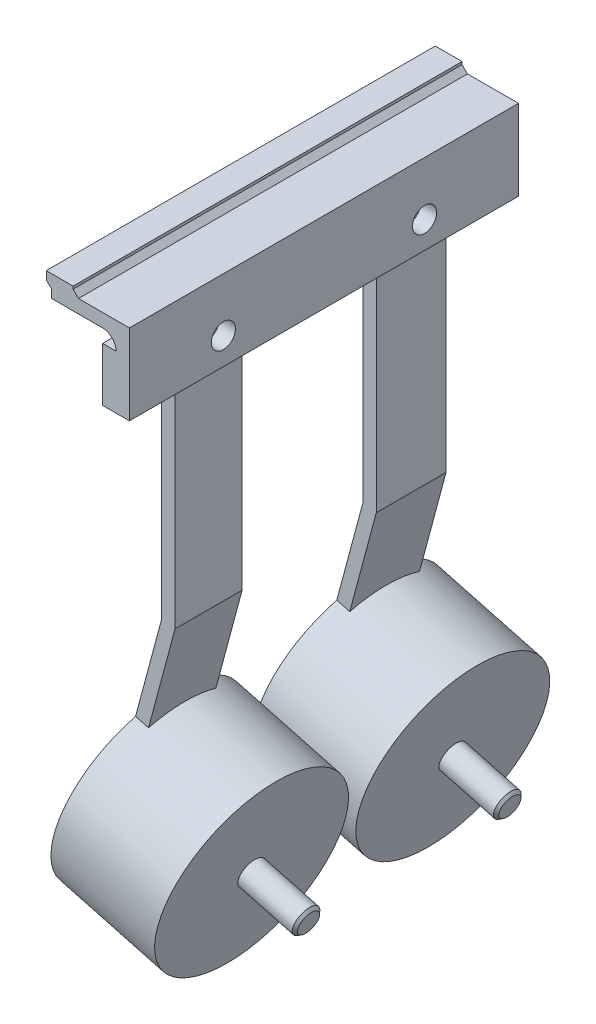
ISO-10303-21;
HEADER;
FILE_DESCRIPTION(('STEP AP214'),'2;1');
FILE_NAME('part.step','',(''),(''),'','','');
FILE_SCHEMA(('AUTOMOTIVE_DESIGN { 1 0 10303 214 1 1 1 1 }'));
ENDSEC;
DATA;
#1=APPLICATION_CONTEXT('core data for automotive mechanical design processes');
#2=APPLICATION_PROTOCOL_DEFINITION('international standard','automotive_design',2000,#1);
#3=PRODUCT_CONTEXT('',#1,'mechanical');
#4=PRODUCT('Part','Part','',(#3));
#5=PRODUCT_RELATED_PRODUCT_CATEGORY('part','',(#4));
#6=PRODUCT_DEFINITION_FORMATION('','',#4);
#7=PRODUCT_DEFINITION_CONTEXT('part definition',#1,'design');
#8=PRODUCT_DEFINITION('design','',#6,#7);
#9=PRODUCT_DEFINITION_SHAPE('','',#8);
#10=(LENGTH_UNIT() NAMED_UNIT(*) SI_UNIT(.MILLI.,.METRE.));
#11=(NAMED_UNIT(*) PLANE_ANGLE_UNIT() SI_UNIT($,.RADIAN.));
#12=(NAMED_UNIT(*) SI_UNIT($,.STERADIAN.) SOLID_ANGLE_UNIT());
#13=UNCERTAINTY_MEASURE_WITH_UNIT(LENGTH_MEASURE(1.E-05),#10,'distance_accuracy_value','');
#14=(GEOMETRIC_REPRESENTATION_CONTEXT(3) GLOBAL_UNCERTAINTY_ASSIGNED_CONTEXT((#13)) GLOBAL_UNIT_ASSIGNED_CONTEXT((#10,
#11,#12)) REPRESENTATION_CONTEXT('',''));
#15=CARTESIAN_POINT('',(0.,0.,0.));
#16=DIRECTION('',(0.,0.,1.));
#17=DIRECTION('',(1.,0.,0.));
#18=AXIS2_PLACEMENT_3D('',#15,#16,#17);
#19=CARTESIAN_POINT('',(-54.1861548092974,140.960408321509,145.));
#20=DIRECTION('',(0.,-1.,0.));
#21=DIRECTION('',(1.,0.,0.));
#22=AXIS2_PLACEMENT_3D('',#19,#20,#21);
#23=PLANE('',#22);
#24=DIRECTION('',(-1.,0.,0.));
#25=VECTOR('',#24,1.);
#26=CARTESIAN_POINT('',(-54.1861548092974,140.960408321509,0.));
#27=LINE('',#26,#25);
#28=CARTESIAN_POINT('',(-54.1861548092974,140.960408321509,0.));
#29=VERTEX_POINT('',#28);
#30=CARTESIAN_POINT('',(-73.1861548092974,140.960408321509,0.));
#31=VERTEX_POINT('',#30);
#32=EDGE_CURVE('E294',#29,#31,#27,.T.);
#33=ORIENTED_EDGE('',*,*,#32,.T.);
#34=DIRECTION('',(0.,0.,1.));
#35=VECTOR('',#34,1.);
#36=CARTESIAN_POINT('',(-73.1861548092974,140.960408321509,145.));
#37=LINE('',#36,#35);
#38=CARTESIAN_POINT('',(-73.1861548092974,140.960408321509,145.));
#39=VERTEX_POINT('',#38);
#40=EDGE_CURVE('E314',#31,#39,#37,.T.);
#41=ORIENTED_EDGE('',*,*,#40,.T.);
#42=DIRECTION('',(-1.,0.,0.));
#43=VECTOR('',#42,1.);
#44=CARTESIAN_POINT('',(-54.1861548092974,140.960408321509,145.));
#45=LINE('',#44,#43);
#46=CARTESIAN_POINT('',(-54.1861548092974,140.960408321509,145.));
#47=VERTEX_POINT('',#46);
#48=EDGE_CURVE('E285',#47,#39,#45,.T.);
#49=ORIENTED_EDGE('',*,*,#48,.F.);
#50=DIRECTION('',(0.,0.,1.));
#51=VECTOR('',#50,1.);
#52=CARTESIAN_POINT('',(-54.1861548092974,140.960408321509,145.));
#53=LINE('',#52,#51);
#54=EDGE_CURVE('E283',#29,#47,#53,.T.);
#55=ORIENTED_EDGE('',*,*,#54,.F.);
#56=EDGE_LOOP('',(#33,#41,#49,#55));
#57=FACE_BOUND('',#56,.T.);
#58=ADVANCED_FACE('F38',(#57),#23,.F.);
#59=CARTESIAN_POINT('',(-64.1861548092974,130.960408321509,145.));
#60=DIRECTION('',(1.,0.,0.));
#61=DIRECTION('',(0.,1.,0.));
#62=AXIS2_PLACEMENT_3D('',#59,#60,#61);
#63=PLANE('',#62);
#64=CARTESIAN_POINT('',(-64.1861548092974,120.960408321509,110.));
#65=DIRECTION('',(-1.,0.,0.));
#66=DIRECTION('',(0.,0.,1.));
#67=AXIS2_PLACEMENT_3D('',#64,#65,#66);
#68=CIRCLE('',#67,8.64999999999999);
#69=CARTESIAN_POINT('',(-64.1861548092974,120.960408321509,118.65));
#70=VERTEX_POINT('',#69);
#71=EDGE_CURVE('E271',#70,#70,#68,.T.);
#72=ORIENTED_EDGE('',*,*,#71,.F.);
#73=EDGE_LOOP('',(#72));
#74=FACE_BOUND('',#73,.T.);
#75=DIRECTION('',(0.,-1.,0.));
#76=VECTOR('',#75,1.);
#77=CARTESIAN_POINT('',(-64.1861548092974,130.960408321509,123.));
#78=LINE('',#77,#76);
#79=CARTESIAN_POINT('',(-64.1861548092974,110.963112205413,123.));
#80=VERTEX_POINT('',#79);
#81=CARTESIAN_POINT('',(-64.1861548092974,30.9604083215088,123.));
#82=VERTEX_POINT('',#81);
#83=EDGE_CURVE('E466',#80,#82,#78,.T.);
#84=ORIENTED_EDGE('',*,*,#83,.F.);
#85=DIRECTION('',(0.,0.,-1.));
#86=VECTOR('',#85,1.);
#87=CARTESIAN_POINT('',(-64.1861548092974,110.963112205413,145.));
#88=LINE('',#87,#86);
#89=CARTESIAN_POINT('',(-64.1861548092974,110.963112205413,145.));
#90=VERTEX_POINT('',#89);
#91=EDGE_CURVE('E443',#90,#80,#88,.T.);
#92=ORIENTED_EDGE('',*,*,#91,.F.);
#93=DIRECTION('',(0.,-1.,0.));
#94=VECTOR('',#93,1.);
#95=CARTESIAN_POINT('',(-64.1861548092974,130.960408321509,145.));
#96=LINE('',#95,#94);
#97=CARTESIAN_POINT('',(-64.1861548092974,130.960408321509,145.));
#98=VERTEX_POINT('',#97);
#99=EDGE_CURVE('E469',#98,#90,#96,.T.);
#100=ORIENTED_EDGE('',*,*,#99,.F.);
#101=DIRECTION('',(0.,0.,-1.));
#102=VECTOR('',#101,1.);
#103=CARTESIAN_POINT('',(-64.1861548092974,130.960408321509,145.));
#104=LINE('',#103,#102);
#105=CARTESIAN_POINT('',(-64.1861548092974,130.960408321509,0.));
#106=VERTEX_POINT('',#105);
#107=EDGE_CURVE('E384',#98,#106,#104,.T.);
#108=ORIENTED_EDGE('',*,*,#107,.T.);
#109=DIRECTION('',(0.,-1.,0.));
#110=VECTOR('',#109,1.);
#111=CARTESIAN_POINT('',(-64.1861548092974,130.960408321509,0.));
#112=LINE('',#111,#110);
#113=CARTESIAN_POINT('',(-64.1861548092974,110.963112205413,0.));
#114=VERTEX_POINT('',#113);
#115=EDGE_CURVE('E468',#106,#114,#112,.T.);
#116=ORIENTED_EDGE('',*,*,#115,.T.);
#117=DIRECTION('',(0.,0.,-1.));
#118=VECTOR('',#117,1.);
#119=CARTESIAN_POINT('',(-64.1861548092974,110.963112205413,145.));
#120=LINE('',#119,#118);
#121=CARTESIAN_POINT('',(-64.1861548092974,110.963112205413,22.));
#122=VERTEX_POINT('',#121);
#123=EDGE_CURVE('E436',#122,#114,#120,.T.);
#124=ORIENTED_EDGE('',*,*,#123,.F.);
#125=DIRECTION('',(0.,1.,0.));
#126=VECTOR('',#125,1.);
#127=CARTESIAN_POINT('',(-64.1861548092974,130.960408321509,22.));
#128=LINE('',#127,#126);
#129=CARTESIAN_POINT('',(-64.1861548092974,30.9604083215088,22.));
#130=VERTEX_POINT('',#129);
#131=EDGE_CURVE('E462',#130,#122,#128,.T.);
#132=ORIENTED_EDGE('',*,*,#131,.F.);
#133=DIRECTION('',(0.,0.,-1.));
#134=VECTOR('',#133,1.);
#135=CARTESIAN_POINT('',(-64.1861548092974,30.9604083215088,145.));
#136=LINE('',#135,#134);
#137=CARTESIAN_POINT('',(-64.1861548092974,30.9604083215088,48.));
#138=VERTEX_POINT('',#137);
#139=EDGE_CURVE('E394',#138,#130,#136,.T.);
#140=ORIENTED_EDGE('',*,*,#139,.F.);
#141=DIRECTION('',(0.,-1.,0.));
#142=VECTOR('',#141,1.);
#143=CARTESIAN_POINT('',(-64.1861548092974,130.960408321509,48.));
#144=LINE('',#143,#142);
#145=CARTESIAN_POINT('',(-64.1861548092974,110.963112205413,48.));
#146=VERTEX_POINT('',#145);
#147=EDGE_CURVE('E458',#146,#138,#144,.T.);
#148=ORIENTED_EDGE('',*,*,#147,.F.);
#149=DIRECTION('',(0.,0.,-1.));
#150=VECTOR('',#149,1.);
#151=CARTESIAN_POINT('',(-64.1861548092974,110.963112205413,145.));
#152=LINE('',#151,#150);
#153=CARTESIAN_POINT('',(-64.1861548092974,110.963112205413,98.));
#154=VERTEX_POINT('',#153);
#155=EDGE_CURVE('E454',#154,#146,#152,.T.);
#156=ORIENTED_EDGE('',*,*,#155,.F.);
#157=DIRECTION('',(0.,1.,0.));
#158=VECTOR('',#157,1.);
#159=CARTESIAN_POINT('',(-64.1861548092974,130.960408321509,98.));
#160=LINE('',#159,#158);
#161=CARTESIAN_POINT('',(-64.1861548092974,30.9604083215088,98.));
#162=VERTEX_POINT('',#161);
#163=EDGE_CURVE('E452',#162,#154,#160,.T.);
#164=ORIENTED_EDGE('',*,*,#163,.F.);
#165=EDGE_CURVE('E397',#82,#162,#136,.T.);
#166=ORIENTED_EDGE('',*,*,#165,.F.);
#167=EDGE_LOOP('',(#84,#92,#100,#108,#116,#124,#132,#140,#148,#156,#164,#166));
#168=FACE_BOUND('',#167,.T.);
#169=CARTESIAN_POINT('',(-64.1861548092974,120.960408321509,35.));
#170=DIRECTION('',(-1.,0.,0.));
#171=DIRECTION('',(0.,0.,1.));
#172=AXIS2_PLACEMENT_3D('',#169,#170,#171);
#173=CIRCLE('',#172,8.64999999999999);
#174=CARTESIAN_POINT('',(-64.1861548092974,120.960408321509,43.65));
#175=VERTEX_POINT('',#174);
#176=EDGE_CURVE('E264',#175,#175,#173,.T.);
#177=ORIENTED_EDGE('',*,*,#176,.F.);
#178=EDGE_LOOP('',(#177));
#179=FACE_BOUND('',#178,.T.);
#180=ADVANCED_FACE('F40',(#74,#168,#179),#63,.F.);
#181=CARTESIAN_POINT('',(-59.1861548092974,30.302145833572,145.));
#182=DIRECTION('',(-1.,0.,0.));
#183=DIRECTION('',(0.,-1.,0.));
#184=AXIS2_PLACEMENT_3D('',#181,#182,#183);
#185=PLANE('',#184);
#186=DIRECTION('',(0.,0.,-1.));
#187=VECTOR('',#186,1.);
#188=CARTESIAN_POINT('',(-59.1861548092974,110.960408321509,145.));
#189=LINE('',#188,#187);
#190=CARTESIAN_POINT('',(-59.1861548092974,110.960408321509,123.));
#191=VERTEX_POINT('',#190);
#192=CARTESIAN_POINT('',(-59.1861548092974,110.960408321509,98.));
#193=VERTEX_POINT('',#192);
#194=EDGE_CURVE('E345',#191,#193,#189,.T.);
#195=ORIENTED_EDGE('',*,*,#194,.F.);
#196=DIRECTION('',(0.,1.,0.));
#197=VECTOR('',#196,1.);
#198=CARTESIAN_POINT('',(-59.1861548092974,30.302145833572,123.));
#199=LINE('',#198,#197);
#200=CARTESIAN_POINT('',(-59.1861548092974,30.3021458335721,123.));
#201=VERTEX_POINT('',#200);
#202=EDGE_CURVE('E361',#201,#191,#199,.T.);
#203=ORIENTED_EDGE('',*,*,#202,.F.);
#204=DIRECTION('',(0.,0.,-1.));
#205=VECTOR('',#204,1.);
#206=CARTESIAN_POINT('',(-59.1861548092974,30.302145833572,145.));
#207=LINE('',#206,#205);
#208=CARTESIAN_POINT('',(-59.1861548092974,30.3021458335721,98.));
#209=VERTEX_POINT('',#208);
#210=EDGE_CURVE('E393',#201,#209,#207,.T.);
#211=ORIENTED_EDGE('',*,*,#210,.T.);
#212=DIRECTION('',(0.,-1.,0.));
#213=VECTOR('',#212,1.);
#214=CARTESIAN_POINT('',(-59.1861548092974,30.302145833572,98.));
#215=LINE('',#214,#213);
#216=EDGE_CURVE('E404',#193,#209,#215,.T.);
#217=ORIENTED_EDGE('',*,*,#216,.F.);
#218=EDGE_LOOP('',(#195,#203,#211,#217));
#219=FACE_BOUND('',#218,.T.);
#220=ADVANCED_FACE('F594',(#219),#185,.F.);
#221=CARTESIAN_POINT('',(-59.1861548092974,110.960408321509,48.));
#222=VERTEX_POINT('',#221);
#223=CARTESIAN_POINT('',(-59.1861548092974,110.960408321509,22.));
#224=VERTEX_POINT('',#223);
#225=EDGE_CURVE('E349',#222,#224,#189,.T.);
#226=ORIENTED_EDGE('',*,*,#225,.F.);
#227=DIRECTION('',(0.,1.,0.));
#228=VECTOR('',#227,1.);
#229=CARTESIAN_POINT('',(-59.1861548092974,30.302145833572,48.));
#230=LINE('',#229,#228);
#231=CARTESIAN_POINT('',(-59.1861548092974,30.3021458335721,48.));
#232=VERTEX_POINT('',#231);
#233=EDGE_CURVE('E370',#232,#222,#230,.T.);
#234=ORIENTED_EDGE('',*,*,#233,.F.);
#235=CARTESIAN_POINT('',(-59.1861548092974,30.3021458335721,22.));
#236=VERTEX_POINT('',#235);
#237=EDGE_CURVE('E383',#232,#236,#207,.T.);
#238=ORIENTED_EDGE('',*,*,#237,.T.);
#239=DIRECTION('',(0.,-1.,0.));
#240=VECTOR('',#239,1.);
#241=CARTESIAN_POINT('',(-59.1861548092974,30.302145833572,22.));
#242=LINE('',#241,#240);
#243=EDGE_CURVE('E368',#224,#236,#242,.T.);
#244=ORIENTED_EDGE('',*,*,#243,.F.);
#245=EDGE_LOOP('',(#226,#234,#238,#244));
#246=FACE_BOUND('',#245,.T.);
#247=ADVANCED_FACE('F630',(#246),#185,.F.);
#248=CARTESIAN_POINT('',(-43.6664549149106,-47.0071613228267,35.));
#249=DIRECTION('',(0.96592582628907,-0.258819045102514,0.));
#250=DIRECTION('',(0.258819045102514,0.96592582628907,0.));
#251=AXIS2_PLACEMENT_3D('',#248,#249,#250);
#252=PLANE('',#251);
#253=CARTESIAN_POINT('',(-43.6664549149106,-47.0071613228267,35.));
#254=DIRECTION('',(0.96592582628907,-0.258819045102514,0.));
#255=DIRECTION('',(0.258819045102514,0.96592582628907,0.));
#256=AXIS2_PLACEMENT_3D('',#253,#254,#255);
#257=CIRCLE('',#256,35.);
#258=CARTESIAN_POINT('',(-34.6077883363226,-13.1997574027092,35.));
#259=VERTEX_POINT('',#258);
#260=EDGE_CURVE('E531',#259,#259,#257,.T.);
#261=ORIENTED_EDGE('',*,*,#260,.T.);
#262=EDGE_LOOP('',(#261));
#263=FACE_BOUND('',#262,.T.);
#264=CARTESIAN_POINT('',(-43.6664549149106,-47.0071613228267,35.));
#265=DIRECTION('',(0.96592582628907,-0.258819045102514,0.));
#266=DIRECTION('',(0.258819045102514,0.96592582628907,0.));
#267=AXIS2_PLACEMENT_3D('',#264,#265,#266);
#268=CIRCLE('',#267,5.);
#269=CARTESIAN_POINT('',(-42.372359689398,-42.1775321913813,35.));
#270=VERTEX_POINT('',#269);
#271=EDGE_CURVE('E539',#270,#270,#268,.T.);
#272=ORIENTED_EDGE('',*,*,#271,.F.);
#273=EDGE_LOOP('',(#272));
#274=FACE_BOUND('',#273,.T.);
#275=ADVANCED_FACE('F626',(#263,#274),#252,.T.);
#276=CARTESIAN_POINT('',(-43.6664549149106,-47.0071613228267,110.));
#277=DIRECTION('',(0.96592582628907,-0.258819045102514,0.));
#278=DIRECTION('',(0.258819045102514,0.96592582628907,0.));
#279=AXIS2_PLACEMENT_3D('',#276,#277,#278);
#280=PLANE('',#279);
#281=CARTESIAN_POINT('',(-43.6664549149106,-47.0071613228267,110.));
#282=DIRECTION('',(0.96592582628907,-0.258819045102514,0.));
#283=DIRECTION('',(0.258819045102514,0.96592582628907,0.));
#284=AXIS2_PLACEMENT_3D('',#281,#282,#283);
#285=CIRCLE('',#284,35.);
#286=CARTESIAN_POINT('',(-34.6077883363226,-13.1997574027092,110.));
#287=VERTEX_POINT('',#286);
#288=EDGE_CURVE('E525',#287,#287,#285,.T.);
#289=ORIENTED_EDGE('',*,*,#288,.T.);
#290=EDGE_LOOP('',(#289));
#291=FACE_BOUND('',#290,.T.);
#292=CARTESIAN_POINT('',(-43.6664549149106,-47.0071613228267,110.));
#293=DIRECTION('',(0.96592582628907,-0.258819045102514,0.));
#294=DIRECTION('',(0.258819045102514,0.96592582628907,0.));
#295=AXIS2_PLACEMENT_3D('',#292,#293,#294);
#296=CIRCLE('',#295,5.00000000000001);
#297=CARTESIAN_POINT('',(-42.372359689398,-42.1775321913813,110.));
#298=VERTEX_POINT('',#297);
#299=EDGE_CURVE('E536',#298,#298,#296,.T.);
#300=ORIENTED_EDGE('',*,*,#299,.F.);
#301=EDGE_LOOP('',(#300));
#302=FACE_BOUND('',#301,.T.);
#303=ADVANCED_FACE('F629',(#291,#302),#280,.T.);
#304=CARTESIAN_POINT('',(-68.4151922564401,-4.14109082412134,145.));
#305=DIRECTION('',(-0.96592582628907,0.258819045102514,0.));
#306=DIRECTION('',(-0.258819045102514,-0.96592582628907,0.));
#307=AXIS2_PLACEMENT_3D('',#304,#305,#306);
#308=PLANE('',#307);
#309=CARTESIAN_POINT('',(-77.473858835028,-37.9484947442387,35.));
#310=DIRECTION('',(0.96592582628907,-0.258819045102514,0.));
#311=DIRECTION('',(0.258819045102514,0.96592582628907,0.));
#312=AXIS2_PLACEMENT_3D('',#309,#310,#311);
#313=CIRCLE('',#312,35.);
#314=CARTESIAN_POINT('',(-69.0632353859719,-6.55962070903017,22.));
#315=VERTEX_POINT('',#314);
#316=CARTESIAN_POINT('',(-69.063235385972,-6.55962070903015,48.));
#317=VERTEX_POINT('',#316);
#318=EDGE_CURVE('E534',#315,#317,#313,.T.);
#319=ORIENTED_EDGE('',*,*,#318,.F.);
#320=DIRECTION('',(0.258819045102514,0.96592582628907,0.));
#321=VECTOR('',#320,1.);
#322=CARTESIAN_POINT('',(-69.063235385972,-6.55962070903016,22.));
#323=LINE('',#322,#321);
#324=EDGE_CURVE('E494',#315,#236,#323,.T.);
#325=ORIENTED_EDGE('',*,*,#324,.T.);
#326=ORIENTED_EDGE('',*,*,#237,.F.);
#327=DIRECTION('',(-0.258819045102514,-0.96592582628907,0.));
#328=VECTOR('',#327,1.);
#329=CARTESIAN_POINT('',(-69.063235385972,-6.55962070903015,48.));
#330=LINE('',#329,#328);
#331=EDGE_CURVE('E513',#232,#317,#330,.T.);
#332=ORIENTED_EDGE('',*,*,#331,.T.);
#333=EDGE_LOOP('',(#319,#325,#326,#332));
#334=FACE_BOUND('',#333,.T.);
#335=ADVANCED_FACE('F634',(#334),#308,.F.);
#336=CARTESIAN_POINT('',(-77.473858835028,-37.9484947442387,110.));
#337=DIRECTION('',(0.96592582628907,-0.258819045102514,0.));
#338=DIRECTION('',(0.258819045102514,0.96592582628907,0.));
#339=AXIS2_PLACEMENT_3D('',#336,#337,#338);
#340=CIRCLE('',#339,35.);
#341=CARTESIAN_POINT('',(-68.9642601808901,-6.19024021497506,98.));
#342=VERTEX_POINT('',#341);
#343=CARTESIAN_POINT('',(-69.063235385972,-6.55962070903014,123.));
#344=VERTEX_POINT('',#343);
#345=EDGE_CURVE('E528',#342,#344,#340,.T.);
#346=ORIENTED_EDGE('',*,*,#345,.F.);
#347=DIRECTION('',(0.258819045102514,0.96592582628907,0.));
#348=VECTOR('',#347,1.);
#349=CARTESIAN_POINT('',(-68.9642601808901,-6.19024021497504,98.));
#350=LINE('',#349,#348);
#351=EDGE_CURVE('E518',#342,#209,#350,.T.);
#352=ORIENTED_EDGE('',*,*,#351,.T.);
#353=ORIENTED_EDGE('',*,*,#210,.F.);
#354=DIRECTION('',(-0.258819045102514,-0.96592582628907,0.));
#355=VECTOR('',#354,1.);
#356=CARTESIAN_POINT('',(-69.063235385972,-6.55962070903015,123.));
#357=LINE('',#356,#355);
#358=EDGE_CURVE('E521',#201,#344,#357,.T.);
#359=ORIENTED_EDGE('',*,*,#358,.T.);
#360=EDGE_LOOP('',(#346,#352,#353,#359));
#361=FACE_BOUND('',#360,.T.);
#362=ADVANCED_FACE('F675',(#361),#308,.F.);
#363=CARTESIAN_POINT('',(-64.1861548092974,30.9604083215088,145.));
#364=DIRECTION('',(0.96592582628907,-0.258819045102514,0.));
#365=DIRECTION('',(0.258819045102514,0.96592582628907,0.));
#366=AXIS2_PLACEMENT_3D('',#363,#364,#365);
#367=PLANE('',#366);
#368=DIRECTION('',(-0.258819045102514,-0.96592582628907,0.));
#369=VECTOR('',#368,1.);
#370=CARTESIAN_POINT('',(-64.1861548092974,30.9604083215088,48.));
#371=LINE('',#370,#369);
#372=CARTESIAN_POINT('',(-73.8928645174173,-5.26552548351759,48.));
#373=VERTEX_POINT('',#372);
#374=EDGE_CURVE('E456',#138,#373,#371,.T.);
#375=ORIENTED_EDGE('',*,*,#374,.F.);
#376=ORIENTED_EDGE('',*,*,#139,.T.);
#377=DIRECTION('',(0.258819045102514,0.96592582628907,0.));
#378=VECTOR('',#377,1.);
#379=CARTESIAN_POINT('',(-64.1861548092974,30.9604083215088,22.));
#380=LINE('',#379,#378);
#381=CARTESIAN_POINT('',(-73.8928645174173,-5.2655254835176,22.));
#382=VERTEX_POINT('',#381);
#383=EDGE_CURVE('E460',#382,#130,#380,.T.);
#384=ORIENTED_EDGE('',*,*,#383,.F.);
#385=CARTESIAN_POINT('',(-82.3034879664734,-36.6543995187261,35.));
#386=DIRECTION('',(0.96592582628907,-0.258819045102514,0.));
#387=DIRECTION('',(0.258819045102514,0.96592582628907,0.));
#388=AXIS2_PLACEMENT_3D('',#385,#386,#387);
#389=CIRCLE('',#388,35.);
#390=EDGE_CURVE('E441',#373,#382,#389,.T.);
#391=ORIENTED_EDGE('',*,*,#390,.F.);
#392=EDGE_LOOP('',(#375,#376,#384,#391));
#393=FACE_BOUND('',#392,.T.);
#394=ADVANCED_FACE('F676',(#393),#367,.F.);
#395=DIRECTION('',(-0.258819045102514,-0.96592582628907,0.));
#396=VECTOR('',#395,1.);
#397=CARTESIAN_POINT('',(-64.1861548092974,30.9604083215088,123.));
#398=LINE('',#397,#396);
#399=CARTESIAN_POINT('',(-73.8928645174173,-5.26552548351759,123.));
#400=VERTEX_POINT('',#399);
#401=EDGE_CURVE('E464',#82,#400,#398,.T.);
#402=ORIENTED_EDGE('',*,*,#401,.F.);
#403=ORIENTED_EDGE('',*,*,#165,.T.);
#404=DIRECTION('',(0.258819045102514,0.96592582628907,0.));
#405=VECTOR('',#404,1.);
#406=CARTESIAN_POINT('',(-64.1861548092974,30.9604083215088,98.));
#407=LINE('',#406,#405);
#408=CARTESIAN_POINT('',(-73.7938893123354,-4.89614498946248,98.));
#409=VERTEX_POINT('',#408);
#410=EDGE_CURVE('E450',#409,#162,#407,.T.);
#411=ORIENTED_EDGE('',*,*,#410,.F.);
#412=CARTESIAN_POINT('',(-82.3034879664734,-36.6543995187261,110.));
#413=DIRECTION('',(0.96592582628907,-0.258819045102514,0.));
#414=DIRECTION('',(0.258819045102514,0.96592582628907,0.));
#415=AXIS2_PLACEMENT_3D('',#412,#413,#414);
#416=CIRCLE('',#415,35.);
#417=EDGE_CURVE('E440',#400,#409,#416,.T.);
#418=ORIENTED_EDGE('',*,*,#417,.F.);
#419=EDGE_LOOP('',(#402,#403,#411,#418));
#420=FACE_BOUND('',#419,.T.);
#421=ADVANCED_FACE('F668',(#420),#367,.F.);
#422=CARTESIAN_POINT('',(-64.1861548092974,130.960408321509,145.));
#423=DIRECTION('',(0.,0.,1.));
#424=DIRECTION('',(1.,0.,0.));
#425=AXIS2_PLACEMENT_3D('',#422,#423,#424);
#426=PLANE('',#425);
#427=DIRECTION('',(-1.,0.,0.));
#428=VECTOR('',#427,1.);
#429=CARTESIAN_POINT('',(-64.1861548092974,110.960408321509,145.));
#430=LINE('',#429,#428);
#431=CARTESIAN_POINT('',(-54.1861548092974,110.960408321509,145.));
#432=VERTEX_POINT('',#431);
#433=CARTESIAN_POINT('',(-64.1760637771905,110.960408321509,145.));
#434=VERTEX_POINT('',#433);
#435=EDGE_CURVE('E542',#432,#434,#430,.T.);
#436=ORIENTED_EDGE('',*,*,#435,.F.);
#437=DIRECTION('',(0.,-1.,0.));
#438=VECTOR('',#437,1.);
#439=CARTESIAN_POINT('',(-54.1861548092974,110.960408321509,145.));
#440=LINE('',#439,#438);
#441=EDGE_CURVE('E275',#47,#432,#440,.T.);
#442=ORIENTED_EDGE('',*,*,#441,.F.);
#443=ORIENTED_EDGE('',*,*,#48,.T.);
#444=DIRECTION('',(0.70710678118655,-0.707106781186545,0.));
#445=VECTOR('',#444,1.);
#446=CARTESIAN_POINT('',(-75.1861548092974,142.960408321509,145.));
#447=LINE('',#446,#445);
#448=CARTESIAN_POINT('',(-75.1861548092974,142.960408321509,145.));
#449=VERTEX_POINT('',#448);
#450=EDGE_CURVE('E230',#39,#449,#447,.F.);
#451=ORIENTED_EDGE('',*,*,#450,.T.);
#452=DIRECTION('',(0.,-1.,0.));
#453=VECTOR('',#452,1.);
#454=CARTESIAN_POINT('',(-75.1861548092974,143.960408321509,145.));
#455=LINE('',#454,#453);
#456=CARTESIAN_POINT('',(-75.1861548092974,143.960408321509,145.));
#457=VERTEX_POINT('',#456);
#458=EDGE_CURVE('E250',#457,#449,#455,.T.);
#459=ORIENTED_EDGE('',*,*,#458,.F.);
#460=DIRECTION('',(1.,0.,0.));
#461=VECTOR('',#460,1.);
#462=CARTESIAN_POINT('',(-75.1861548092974,143.960408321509,145.));
#463=LINE('',#462,#461);
#464=CARTESIAN_POINT('',(-85.1861548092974,143.960408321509,145.));
#465=VERTEX_POINT('',#464);
#466=EDGE_CURVE('E248',#465,#457,#463,.T.);
#467=ORIENTED_EDGE('',*,*,#466,.F.);
#468=DIRECTION('',(0.,-1.,0.));
#469=VECTOR('',#468,1.);
#470=CARTESIAN_POINT('',(-85.1861548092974,143.960408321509,145.));
#471=LINE('',#470,#469);
#472=CARTESIAN_POINT('',(-85.1861548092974,140.960408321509,145.));
#473=VERTEX_POINT('',#472);
#474=EDGE_CURVE('E237',#465,#473,#471,.T.);
#475=ORIENTED_EDGE('',*,*,#474,.T.);
#476=DIRECTION('',(0.707106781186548,-0.707106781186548,0.));
#477=VECTOR('',#476,1.);
#478=CARTESIAN_POINT('',(-83.1861548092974,138.960408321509,145.));
#479=LINE('',#478,#477);
#480=CARTESIAN_POINT('',(-83.1861548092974,138.960408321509,145.));
#481=VERTEX_POINT('',#480);
#482=EDGE_CURVE('E11',#473,#481,#479,.T.);
#483=ORIENTED_EDGE('',*,*,#482,.T.);
#484=DIRECTION('',(0.,1.,0.));
#485=VECTOR('',#484,1.);
#486=CARTESIAN_POINT('',(-83.1861548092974,140.960408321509,145.));
#487=LINE('',#486,#485);
#488=CARTESIAN_POINT('',(-83.1861548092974,135.960408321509,145.));
#489=VERTEX_POINT('',#488);
#490=EDGE_CURVE('E254',#489,#481,#487,.T.);
#491=ORIENTED_EDGE('',*,*,#490,.F.);
#492=DIRECTION('',(1.,0.,0.));
#493=VECTOR('',#492,1.);
#494=CARTESIAN_POINT('',(-83.1861548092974,135.960408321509,145.));
#495=LINE('',#494,#493);
#496=CARTESIAN_POINT('',(-64.1861548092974,135.960408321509,145.));
#497=VERTEX_POINT('',#496);
#498=EDGE_CURVE('E255',#489,#497,#495,.T.);
#499=ORIENTED_EDGE('',*,*,#498,.T.);
#500=CARTESIAN_POINT('',(-64.1861548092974,130.960408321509,145.));
#501=DIRECTION('',(0.,0.,1.));
#502=DIRECTION('',(1.,0.,0.));
#503=AXIS2_PLACEMENT_3D('',#500,#501,#502);
#504=CIRCLE('',#503,5.);
#505=CARTESIAN_POINT('',(-59.1861548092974,130.960408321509,145.));
#506=VERTEX_POINT('',#505);
#507=EDGE_CURVE('E337',#497,#506,#504,.F.);
#508=ORIENTED_EDGE('',*,*,#507,.T.);
#509=DIRECTION('',(-1.,0.,0.));
#510=VECTOR('',#509,1.);
#511=CARTESIAN_POINT('',(-64.1861548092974,130.960408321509,145.));
#512=LINE('',#511,#510);
#513=EDGE_CURVE('E471',#506,#98,#512,.T.);
#514=ORIENTED_EDGE('',*,*,#513,.T.);
#515=ORIENTED_EDGE('',*,*,#99,.T.);
#516=DIRECTION('',(0.96592582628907,-0.258819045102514,0.));
#517=VECTOR('',#516,1.);
#518=CARTESIAN_POINT('',(-69.1854788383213,112.302677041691,145.));
#519=LINE('',#518,#517);
#520=EDGE_CURVE('E401',#90,#434,#519,.T.);
#521=ORIENTED_EDGE('',*,*,#520,.T.);
#522=EDGE_LOOP('',(#436,#442,#443,#451,#459,#467,#475,#483,#491,#499,#508,#514,#515,#521));
#523=FACE_BOUND('',#522,.T.);
#524=ADVANCED_FACE('F322',(#523),#426,.T.);
#525=CARTESIAN_POINT('',(-64.1861548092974,130.960408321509,0.));
#526=DIRECTION('',(0.,0.,1.));
#527=DIRECTION('',(1.,0.,0.));
#528=AXIS2_PLACEMENT_3D('',#525,#526,#527);
#529=PLANE('',#528);
#530=DIRECTION('',(-1.,0.,0.));
#531=VECTOR('',#530,1.);
#532=CARTESIAN_POINT('',(-64.1861548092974,130.960408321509,0.));
#533=LINE('',#532,#531);
#534=CARTESIAN_POINT('',(-59.1861548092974,130.960408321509,0.));
#535=VERTEX_POINT('',#534);
#536=EDGE_CURVE('E385',#535,#106,#533,.T.);
#537=ORIENTED_EDGE('',*,*,#536,.F.);
#538=CARTESIAN_POINT('',(-64.1861548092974,130.960408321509,0.));
#539=DIRECTION('',(0.,0.,1.));
#540=DIRECTION('',(1.,0.,0.));
#541=AXIS2_PLACEMENT_3D('',#538,#539,#540);
#542=CIRCLE('',#541,5.);
#543=CARTESIAN_POINT('',(-64.1861548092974,135.960408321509,0.));
#544=VERTEX_POINT('',#543);
#545=EDGE_CURVE('E336',#535,#544,#542,.T.);
#546=ORIENTED_EDGE('',*,*,#545,.T.);
#547=DIRECTION('',(1.,0.,0.));
#548=VECTOR('',#547,1.);
#549=CARTESIAN_POINT('',(-83.1861548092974,135.960408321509,0.));
#550=LINE('',#549,#548);
#551=CARTESIAN_POINT('',(-83.1861548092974,135.960408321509,0.));
#552=VERTEX_POINT('',#551);
#553=EDGE_CURVE('E258',#552,#544,#550,.T.);
#554=ORIENTED_EDGE('',*,*,#553,.F.);
#555=DIRECTION('',(0.,-1.,0.));
#556=VECTOR('',#555,1.);
#557=CARTESIAN_POINT('',(-83.1861548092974,140.960408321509,0.));
#558=LINE('',#557,#556);
#559=CARTESIAN_POINT('',(-83.1861548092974,138.960408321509,0.));
#560=VERTEX_POINT('',#559);
#561=EDGE_CURVE('E229',#560,#552,#558,.T.);
#562=ORIENTED_EDGE('',*,*,#561,.F.);
#563=DIRECTION('',(-0.707106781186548,0.707106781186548,0.));
#564=VECTOR('',#563,1.);
#565=CARTESIAN_POINT('',(-69.6861548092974,125.460408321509,0.));
#566=LINE('',#565,#564);
#567=CARTESIAN_POINT('',(-85.1861548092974,140.960408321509,0.));
#568=VERTEX_POINT('',#567);
#569=EDGE_CURVE('E46',#560,#568,#566,.T.);
#570=ORIENTED_EDGE('',*,*,#569,.T.);
#571=DIRECTION('',(0.,-1.,0.));
#572=VECTOR('',#571,1.);
#573=CARTESIAN_POINT('',(-85.1861548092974,143.960408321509,0.));
#574=LINE('',#573,#572);
#575=CARTESIAN_POINT('',(-85.1861548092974,143.960408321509,0.));
#576=VERTEX_POINT('',#575);
#577=EDGE_CURVE('E226',#576,#568,#574,.T.);
#578=ORIENTED_EDGE('',*,*,#577,.F.);
#579=DIRECTION('',(-1.,0.,0.));
#580=VECTOR('',#579,1.);
#581=CARTESIAN_POINT('',(-75.1861548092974,143.960408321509,0.));
#582=LINE('',#581,#580);
#583=CARTESIAN_POINT('',(-75.1861548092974,143.960408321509,0.));
#584=VERTEX_POINT('',#583);
#585=EDGE_CURVE('E243',#584,#576,#582,.T.);
#586=ORIENTED_EDGE('',*,*,#585,.F.);
#587=DIRECTION('',(0.,-1.,0.));
#588=VECTOR('',#587,1.);
#589=CARTESIAN_POINT('',(-75.1861548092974,143.960408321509,0.));
#590=LINE('',#589,#588);
#591=CARTESIAN_POINT('',(-75.1861548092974,142.960408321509,0.));
#592=VERTEX_POINT('',#591);
#593=EDGE_CURVE('E236',#584,#592,#590,.T.);
#594=ORIENTED_EDGE('',*,*,#593,.T.);
#595=DIRECTION('',(-0.70710678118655,0.707106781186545,0.));
#596=VECTOR('',#595,1.);
#597=CARTESIAN_POINT('',(-63.6861548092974,131.460408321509,0.));
#598=LINE('',#597,#596);
#599=EDGE_CURVE('E318',#592,#31,#598,.F.);
#600=ORIENTED_EDGE('',*,*,#599,.T.);
#601=ORIENTED_EDGE('',*,*,#32,.F.);
#602=DIRECTION('',(0.,1.,0.));
#603=VECTOR('',#602,1.);
#604=CARTESIAN_POINT('',(-54.1861548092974,110.960408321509,0.));
#605=LINE('',#604,#603);
#606=CARTESIAN_POINT('',(-54.1861548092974,110.960408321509,0.));
#607=VERTEX_POINT('',#606);
#608=EDGE_CURVE('E281',#607,#29,#605,.T.);
#609=ORIENTED_EDGE('',*,*,#608,.F.);
#610=DIRECTION('',(-1.,0.,0.));
#611=VECTOR('',#610,1.);
#612=CARTESIAN_POINT('',(-64.1861548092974,110.960408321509,0.));
#613=LINE('',#612,#611);
#614=CARTESIAN_POINT('',(-64.1760637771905,110.960408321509,0.));
#615=VERTEX_POINT('',#614);
#616=EDGE_CURVE('E376',#607,#615,#613,.T.);
#617=ORIENTED_EDGE('',*,*,#616,.T.);
#618=DIRECTION('',(0.96592582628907,-0.258819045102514,0.));
#619=VECTOR('',#618,1.);
#620=CARTESIAN_POINT('',(-69.1854788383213,112.302677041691,0.));
#621=LINE('',#620,#619);
#622=EDGE_CURVE('E398',#114,#615,#621,.T.);
#623=ORIENTED_EDGE('',*,*,#622,.F.);
#624=ORIENTED_EDGE('',*,*,#115,.F.);
#625=EDGE_LOOP('',(#537,#546,#554,#562,#570,#578,#586,#594,#600,#601,#609,#617,#623,#624));
#626=FACE_BOUND('',#625,.T.);
#627=ADVANCED_FACE('F225',(#626),#529,.F.);
#628=CARTESIAN_POINT('',(-64.1861548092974,130.960408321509,145.));
#629=DIRECTION('',(0.,-1.,0.));
#630=DIRECTION('',(0.,0.,-1.));
#631=AXIS2_PLACEMENT_3D('',#628,#629,#630);
#632=PLANE('',#631);
#633=ORIENTED_EDGE('',*,*,#536,.T.);
#634=ORIENTED_EDGE('',*,*,#107,.F.);
#635=ORIENTED_EDGE('',*,*,#513,.F.);
#636=DIRECTION('',(0.,0.,-1.));
#637=VECTOR('',#636,1.);
#638=CARTESIAN_POINT('',(-59.1861548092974,130.960408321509,145.));
#639=LINE('',#638,#637);
#640=EDGE_CURVE('E380',#506,#535,#639,.T.);
#641=ORIENTED_EDGE('',*,*,#640,.T.);
#642=EDGE_LOOP('',(#633,#634,#635,#641));
#643=FACE_BOUND('',#642,.T.);
#644=ADVANCED_FACE('F476',(#643),#632,.F.);
#645=CARTESIAN_POINT('',(-124.248417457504,8.22720426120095,123.));
#646=DIRECTION('',(0.,0.,1.));
#647=DIRECTION('',(1.,0.,0.));
#648=AXIS2_PLACEMENT_3D('',#645,#646,#647);
#649=PLANE('',#648);
#650=ORIENTED_EDGE('',*,*,#202,.T.);
#651=DIRECTION('',(1.,0.,0.));
#652=VECTOR('',#651,1.);
#653=CARTESIAN_POINT('',(-91.3621545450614,110.960408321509,123.));
#654=LINE('',#653,#652);
#655=CARTESIAN_POINT('',(-64.1760637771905,110.960408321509,123.));
#656=VERTEX_POINT('',#655);
#657=EDGE_CURVE('E432',#656,#191,#654,.T.);
#658=ORIENTED_EDGE('',*,*,#657,.F.);
#659=DIRECTION('',(0.96592582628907,-0.258819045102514,0.));
#660=VECTOR('',#659,1.);
#661=CARTESIAN_POINT('',(-94.5410317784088,119.096676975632,123.));
#662=LINE('',#661,#660);
#663=EDGE_CURVE('E445',#80,#656,#662,.T.);
#664=ORIENTED_EDGE('',*,*,#663,.F.);
#665=ORIENTED_EDGE('',*,*,#83,.T.);
#666=ORIENTED_EDGE('',*,*,#401,.T.);
#667=DIRECTION('',(0.96592582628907,-0.258819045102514,0.));
#668=VECTOR('',#667,1.);
#669=CARTESIAN_POINT('',(-124.248417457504,8.22720426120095,123.));
#670=LINE('',#669,#668);
#671=EDGE_CURVE('E509',#400,#344,#670,.T.);
#672=ORIENTED_EDGE('',*,*,#671,.T.);
#673=ORIENTED_EDGE('',*,*,#358,.F.);
#674=EDGE_LOOP('',(#650,#658,#664,#665,#666,#672,#673));
#675=FACE_BOUND('',#674,.T.);
#676=ADVANCED_FACE('F488',(#675),#649,.T.);
#677=CARTESIAN_POINT('',(-124.248417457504,8.22720426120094,22.));
#678=DIRECTION('',(0.,0.,-1.));
#679=DIRECTION('',(0.,1.,0.));
#680=AXIS2_PLACEMENT_3D('',#677,#678,#679);
#681=PLANE('',#680);
#682=ORIENTED_EDGE('',*,*,#131,.T.);
#683=DIRECTION('',(0.96592582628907,-0.258819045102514,0.));
#684=VECTOR('',#683,1.);
#685=CARTESIAN_POINT('',(-94.5410317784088,119.096676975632,22.));
#686=LINE('',#685,#684);
#687=CARTESIAN_POINT('',(-64.1760637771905,110.960408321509,22.));
#688=VERTEX_POINT('',#687);
#689=EDGE_CURVE('E437',#122,#688,#686,.T.);
#690=ORIENTED_EDGE('',*,*,#689,.T.);
#691=DIRECTION('',(1.,0.,0.));
#692=VECTOR('',#691,1.);
#693=CARTESIAN_POINT('',(-91.3621545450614,110.960408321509,22.));
#694=LINE('',#693,#692);
#695=EDGE_CURVE('E373',#688,#224,#694,.T.);
#696=ORIENTED_EDGE('',*,*,#695,.T.);
#697=ORIENTED_EDGE('',*,*,#243,.T.);
#698=ORIENTED_EDGE('',*,*,#324,.F.);
#699=DIRECTION('',(0.96592582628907,-0.258819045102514,0.));
#700=VECTOR('',#699,1.);
#701=CARTESIAN_POINT('',(-124.248417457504,8.22720426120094,22.));
#702=LINE('',#701,#700);
#703=EDGE_CURVE('E491',#382,#315,#702,.T.);
#704=ORIENTED_EDGE('',*,*,#703,.F.);
#705=ORIENTED_EDGE('',*,*,#383,.T.);
#706=EDGE_LOOP('',(#682,#690,#696,#697,#698,#704,#705));
#707=FACE_BOUND('',#706,.T.);
#708=ADVANCED_FACE('F642',(#707),#681,.T.);
#709=CARTESIAN_POINT('',(-124.248417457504,8.22720426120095,48.));
#710=DIRECTION('',(0.,0.,1.));
#711=DIRECTION('',(1.,0.,0.));
#712=AXIS2_PLACEMENT_3D('',#709,#710,#711);
#713=PLANE('',#712);
#714=ORIENTED_EDGE('',*,*,#147,.T.);
#715=ORIENTED_EDGE('',*,*,#374,.T.);
#716=DIRECTION('',(0.96592582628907,-0.258819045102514,0.));
#717=VECTOR('',#716,1.);
#718=CARTESIAN_POINT('',(-124.248417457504,8.22720426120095,48.));
#719=LINE('',#718,#717);
#720=EDGE_CURVE('E499',#373,#317,#719,.T.);
#721=ORIENTED_EDGE('',*,*,#720,.T.);
#722=ORIENTED_EDGE('',*,*,#331,.F.);
#723=ORIENTED_EDGE('',*,*,#233,.T.);
#724=DIRECTION('',(1.,0.,0.));
#725=VECTOR('',#724,1.);
#726=CARTESIAN_POINT('',(-91.3621545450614,110.960408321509,48.));
#727=LINE('',#726,#725);
#728=CARTESIAN_POINT('',(-64.1760637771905,110.960408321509,48.));
#729=VERTEX_POINT('',#728);
#730=EDGE_CURVE('E548',#729,#222,#727,.T.);
#731=ORIENTED_EDGE('',*,*,#730,.F.);
#732=DIRECTION('',(0.96592582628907,-0.258819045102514,0.));
#733=VECTOR('',#732,1.);
#734=CARTESIAN_POINT('',(-94.5410317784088,119.096676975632,48.));
#735=LINE('',#734,#733);
#736=EDGE_CURVE('E501',#146,#729,#735,.T.);
#737=ORIENTED_EDGE('',*,*,#736,.F.);
#738=EDGE_LOOP('',(#714,#715,#721,#722,#723,#731,#737));
#739=FACE_BOUND('',#738,.T.);
#740=ADVANCED_FACE('F645',(#739),#713,.T.);
#741=CARTESIAN_POINT('',(-94.5410317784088,119.096676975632,98.));
#742=DIRECTION('',(-0.258819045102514,-0.96592582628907,0.));
#743=DIRECTION('',(0.96592582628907,-0.258819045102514,0.));
#744=AXIS2_PLACEMENT_3D('',#741,#742,#743);
#745=PLANE('',#744);
#746=DIRECTION('',(0.,0.,-1.));
#747=VECTOR('',#746,1.);
#748=CARTESIAN_POINT('',(-64.1760637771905,110.960408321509,98.));
#749=LINE('',#748,#747);
#750=CARTESIAN_POINT('',(-64.1760637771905,110.960408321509,98.));
#751=VERTEX_POINT('',#750);
#752=EDGE_CURVE('E377',#751,#729,#749,.T.);
#753=ORIENTED_EDGE('',*,*,#752,.F.);
#754=DIRECTION('',(0.96592582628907,-0.258819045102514,0.));
#755=VECTOR('',#754,1.);
#756=CARTESIAN_POINT('',(-94.5410317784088,119.096676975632,98.));
#757=LINE('',#756,#755);
#758=EDGE_CURVE('E504',#154,#751,#757,.T.);
#759=ORIENTED_EDGE('',*,*,#758,.F.);
#760=ORIENTED_EDGE('',*,*,#155,.T.);
#761=ORIENTED_EDGE('',*,*,#736,.T.);
#762=EDGE_LOOP('',(#753,#759,#760,#761));
#763=FACE_BOUND('',#762,.T.);
#764=ADVANCED_FACE('F652',(#763),#745,.T.);
#765=CARTESIAN_POINT('',(-124.149442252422,8.59658475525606,98.));
#766=DIRECTION('',(0.,0.,-1.));
#767=DIRECTION('',(-1.,0.,0.));
#768=AXIS2_PLACEMENT_3D('',#765,#766,#767);
#769=PLANE('',#768);
#770=ORIENTED_EDGE('',*,*,#758,.T.);
#771=DIRECTION('',(1.,0.,0.));
#772=VECTOR('',#771,1.);
#773=CARTESIAN_POINT('',(-91.3621545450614,110.960408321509,98.));
#774=LINE('',#773,#772);
#775=EDGE_CURVE('E544',#751,#193,#774,.T.);
#776=ORIENTED_EDGE('',*,*,#775,.T.);
#777=ORIENTED_EDGE('',*,*,#216,.T.);
#778=ORIENTED_EDGE('',*,*,#351,.F.);
#779=DIRECTION('',(0.96592582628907,-0.258819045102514,0.));
#780=VECTOR('',#779,1.);
#781=CARTESIAN_POINT('',(-124.149442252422,8.59658475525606,98.));
#782=LINE('',#781,#780);
#783=EDGE_CURVE('E507',#409,#342,#782,.T.);
#784=ORIENTED_EDGE('',*,*,#783,.F.);
#785=ORIENTED_EDGE('',*,*,#410,.T.);
#786=ORIENTED_EDGE('',*,*,#163,.T.);
#787=EDGE_LOOP('',(#770,#776,#777,#778,#784,#785,#786));
#788=FACE_BOUND('',#787,.T.);
#789=ADVANCED_FACE('F639',(#788),#769,.T.);
#790=CARTESIAN_POINT('',(-94.5410317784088,119.096676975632,145.));
#791=DIRECTION('',(-0.258819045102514,-0.96592582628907,0.));
#792=DIRECTION('',(0.96592582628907,-0.258819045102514,0.));
#793=AXIS2_PLACEMENT_3D('',#790,#791,#792);
#794=PLANE('',#793);
#795=DIRECTION('',(0.,0.,-1.));
#796=VECTOR('',#795,1.);
#797=CARTESIAN_POINT('',(-64.1760637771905,110.960408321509,145.));
#798=LINE('',#797,#796);
#799=EDGE_CURVE('E416',#434,#656,#798,.T.);
#800=ORIENTED_EDGE('',*,*,#799,.F.);
#801=ORIENTED_EDGE('',*,*,#520,.F.);
#802=ORIENTED_EDGE('',*,*,#91,.T.);
#803=ORIENTED_EDGE('',*,*,#663,.T.);
#804=EDGE_LOOP('',(#800,#801,#802,#803));
#805=FACE_BOUND('',#804,.T.);
#806=ADVANCED_FACE('F485',(#805),#794,.T.);
#807=CARTESIAN_POINT('',(-132.65904090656,-23.1616697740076,110.));
#808=DIRECTION('',(0.96592582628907,-0.258819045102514,0.));
#809=DIRECTION('',(0.258819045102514,0.96592582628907,0.));
#810=AXIS2_PLACEMENT_3D('',#807,#808,#809);
#811=CYLINDRICAL_SURFACE('',#810,35.);
#812=ORIENTED_EDGE('',*,*,#417,.T.);
#813=ORIENTED_EDGE('',*,*,#783,.T.);
#814=ORIENTED_EDGE('',*,*,#345,.T.);
#815=ORIENTED_EDGE('',*,*,#671,.F.);
#816=EDGE_LOOP('',(#812,#813,#814,#815));
#817=FACE_BOUND('',#816,.T.);
#818=ORIENTED_EDGE('',*,*,#288,.F.);
#819=EDGE_LOOP('',(#818));
#820=FACE_BOUND('',#819,.T.);
#821=ADVANCED_FACE('F638',(#817,#820),#811,.T.);
#822=CARTESIAN_POINT('',(-94.5410317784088,119.096676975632,22.));
#823=DIRECTION('',(-0.258819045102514,-0.96592582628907,0.));
#824=DIRECTION('',(0.96592582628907,-0.258819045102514,0.));
#825=AXIS2_PLACEMENT_3D('',#822,#823,#824);
#826=PLANE('',#825);
#827=DIRECTION('',(0.,0.,-1.));
#828=VECTOR('',#827,1.);
#829=CARTESIAN_POINT('',(-64.1760637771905,110.960408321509,22.));
#830=LINE('',#829,#828);
#831=EDGE_CURVE('E354',#688,#615,#830,.T.);
#832=ORIENTED_EDGE('',*,*,#831,.F.);
#833=ORIENTED_EDGE('',*,*,#689,.F.);
#834=ORIENTED_EDGE('',*,*,#123,.T.);
#835=ORIENTED_EDGE('',*,*,#622,.T.);
#836=EDGE_LOOP('',(#832,#833,#834,#835));
#837=FACE_BOUND('',#836,.T.);
#838=ADVANCED_FACE('F434',(#837),#826,.T.);
#839=CARTESIAN_POINT('',(-132.65904090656,-23.1616697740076,35.));
#840=DIRECTION('',(0.96592582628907,-0.258819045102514,0.));
#841=DIRECTION('',(0.258819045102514,0.96592582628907,0.));
#842=AXIS2_PLACEMENT_3D('',#839,#840,#841);
#843=CYLINDRICAL_SURFACE('',#842,35.);
#844=ORIENTED_EDGE('',*,*,#390,.T.);
#845=ORIENTED_EDGE('',*,*,#703,.T.);
#846=ORIENTED_EDGE('',*,*,#318,.T.);
#847=ORIENTED_EDGE('',*,*,#720,.F.);
#848=EDGE_LOOP('',(#844,#845,#846,#847));
#849=FACE_BOUND('',#848,.T.);
#850=ORIENTED_EDGE('',*,*,#260,.F.);
#851=EDGE_LOOP('',(#850));
#852=FACE_BOUND('',#851,.T.);
#853=ADVANCED_FACE('F624',(#849,#852),#843,.T.);
#854=CARTESIAN_POINT('',(-22.416086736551,-52.701180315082,110.));
#855=DIRECTION('',(-0.96592582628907,0.258819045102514,0.));
#856=DIRECTION('',(-0.258819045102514,-0.96592582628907,0.));
#857=AXIS2_PLACEMENT_3D('',#854,#855,#856);
#858=CYLINDRICAL_SURFACE('',#857,5.00000000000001);
#859=CARTESIAN_POINT('',(-23.3820125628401,-52.4423612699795,110.));
#860=DIRECTION('',(0.965925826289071,-0.258819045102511,0.));
#861=DIRECTION('',(0.258819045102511,0.965925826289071,0.));
#862=AXIS2_PLACEMENT_3D('',#859,#860,#861);
#863=CIRCLE('',#862,5.00000000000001);
#864=CARTESIAN_POINT('',(-22.0879173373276,-47.6127321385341,110.));
#865=VERTEX_POINT('',#864);
#866=EDGE_CURVE('E414',#865,#865,#863,.F.);
#867=ORIENTED_EDGE('',*,*,#866,.T.);
#868=EDGE_LOOP('',(#867));
#869=FACE_BOUND('',#868,.T.);
#870=ORIENTED_EDGE('',*,*,#299,.T.);
#871=EDGE_LOOP('',(#870));
#872=FACE_BOUND('',#871,.T.);
#873=ADVANCED_FACE('F620',(#869,#872),#858,.T.);
#874=CARTESIAN_POINT('',(-22.416086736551,-52.701180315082,110.));
#875=DIRECTION('',(0.96592582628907,-0.258819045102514,0.));
#876=DIRECTION('',(0.258819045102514,0.96592582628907,0.));
#877=AXIS2_PLACEMENT_3D('',#874,#875,#876);
#878=PLANE('',#877);
#879=CARTESIAN_POINT('',(-22.416086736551,-52.701180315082,110.));
#880=DIRECTION('',(0.96592582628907,-0.258819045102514,0.));
#881=DIRECTION('',(0.258819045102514,0.96592582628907,0.));
#882=AXIS2_PLACEMENT_3D('',#879,#880,#881);
#883=CIRCLE('',#882,4.00000000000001);
#884=CARTESIAN_POINT('',(-21.380810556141,-48.8374770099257,110.));
#885=VERTEX_POINT('',#884);
#886=EDGE_CURVE('E411',#885,#885,#883,.T.);
#887=ORIENTED_EDGE('',*,*,#886,.T.);
#888=EDGE_LOOP('',(#887));
#889=FACE_BOUND('',#888,.T.);
#890=ADVANCED_FACE('F616',(#889),#878,.T.);
#891=CARTESIAN_POINT('',(-22.416086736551,-52.701180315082,35.));
#892=DIRECTION('',(-0.96592582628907,0.258819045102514,0.));
#893=DIRECTION('',(-0.258819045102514,-0.96592582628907,0.));
#894=AXIS2_PLACEMENT_3D('',#891,#892,#893);
#895=CYLINDRICAL_SURFACE('',#894,5.);
#896=CARTESIAN_POINT('',(-23.3820125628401,-52.4423612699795,35.));
#897=DIRECTION('',(0.96592582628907,-0.258819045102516,0.));
#898=DIRECTION('',(0.258819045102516,0.96592582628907,0.));
#899=AXIS2_PLACEMENT_3D('',#896,#897,#898);
#900=CIRCLE('',#899,5.);
#901=CARTESIAN_POINT('',(-22.0879173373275,-47.6127321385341,35.));
#902=VERTEX_POINT('',#901);
#903=EDGE_CURVE('E408',#902,#902,#900,.F.);
#904=ORIENTED_EDGE('',*,*,#903,.T.);
#905=EDGE_LOOP('',(#904));
#906=FACE_BOUND('',#905,.T.);
#907=ORIENTED_EDGE('',*,*,#271,.T.);
#908=EDGE_LOOP('',(#907));
#909=FACE_BOUND('',#908,.T.);
#910=ADVANCED_FACE('F612',(#906,#909),#895,.T.);
#911=CARTESIAN_POINT('',(-22.416086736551,-52.701180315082,35.));
#912=DIRECTION('',(0.96592582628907,-0.258819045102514,0.));
#913=DIRECTION('',(0.258819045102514,0.96592582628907,0.));
#914=AXIS2_PLACEMENT_3D('',#911,#912,#913);
#915=PLANE('',#914);
#916=CARTESIAN_POINT('',(-22.416086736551,-52.701180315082,35.));
#917=DIRECTION('',(0.96592582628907,-0.258819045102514,0.));
#918=DIRECTION('',(0.258819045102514,0.96592582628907,0.));
#919=AXIS2_PLACEMENT_3D('',#916,#917,#918);
#920=CIRCLE('',#919,4.00000000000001);
#921=CARTESIAN_POINT('',(-21.380810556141,-48.8374770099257,35.));
#922=VERTEX_POINT('',#921);
#923=EDGE_CURVE('E405',#922,#922,#920,.T.);
#924=ORIENTED_EDGE('',*,*,#923,.T.);
#925=EDGE_LOOP('',(#924));
#926=FACE_BOUND('',#925,.T.);
#927=ADVANCED_FACE('F608',(#926),#915,.T.);
#928=CARTESIAN_POINT('',(-22.416086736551,-52.701180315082,35.));
#929=DIRECTION('',(-0.96592582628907,0.258819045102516,0.));
#930=DIRECTION('',(-0.258819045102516,-0.96592582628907,0.));
#931=AXIS2_PLACEMENT_3D('',#928,#929,#930);
#932=CONICAL_SURFACE('',#931,4.,0.785398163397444);
#933=ORIENTED_EDGE('',*,*,#903,.F.);
#934=EDGE_LOOP('',(#933));
#935=FACE_BOUND('',#934,.T.);
#936=ORIENTED_EDGE('',*,*,#923,.F.);
#937=EDGE_LOOP('',(#936));
#938=FACE_BOUND('',#937,.T.);
#939=ADVANCED_FACE('F604',(#935,#938),#932,.T.);
#940=CARTESIAN_POINT('',(-22.416086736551,-52.701180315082,110.));
#941=DIRECTION('',(-0.965925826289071,0.258819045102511,0.));
#942=DIRECTION('',(-0.258819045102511,-0.965925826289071,0.));
#943=AXIS2_PLACEMENT_3D('',#940,#941,#942);
#944=CONICAL_SURFACE('',#943,4.00000000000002,0.78539816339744);
#945=ORIENTED_EDGE('',*,*,#866,.F.);
#946=EDGE_LOOP('',(#945));
#947=FACE_BOUND('',#946,.T.);
#948=ORIENTED_EDGE('',*,*,#886,.F.);
#949=EDGE_LOOP('',(#948));
#950=FACE_BOUND('',#949,.T.);
#951=ADVANCED_FACE('F601',(#947,#950),#944,.T.);
#952=CARTESIAN_POINT('',(-91.3621545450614,110.960408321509,150.366344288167));
#953=DIRECTION('',(0.,1.,0.));
#954=DIRECTION('',(-1.,0.,0.));
#955=AXIS2_PLACEMENT_3D('',#952,#953,#954);
#956=PLANE('',#955);
#957=ORIENTED_EDGE('',*,*,#435,.T.);
#958=ORIENTED_EDGE('',*,*,#799,.T.);
#959=ORIENTED_EDGE('',*,*,#657,.T.);
#960=ORIENTED_EDGE('',*,*,#194,.T.);
#961=ORIENTED_EDGE('',*,*,#775,.F.);
#962=ORIENTED_EDGE('',*,*,#752,.T.);
#963=ORIENTED_EDGE('',*,*,#730,.T.);
#964=ORIENTED_EDGE('',*,*,#225,.T.);
#965=ORIENTED_EDGE('',*,*,#695,.F.);
#966=ORIENTED_EDGE('',*,*,#831,.T.);
#967=ORIENTED_EDGE('',*,*,#616,.F.);
#968=DIRECTION('',(0.,0.,-1.));
#969=VECTOR('',#968,1.);
#970=CARTESIAN_POINT('',(-54.1861548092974,110.960408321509,145.));
#971=LINE('',#970,#969);
#972=EDGE_CURVE('E278',#432,#607,#971,.T.);
#973=ORIENTED_EDGE('',*,*,#972,.F.);
#974=EDGE_LOOP('',(#957,#958,#959,#960,#961,#962,#963,#964,#965,#966,#967,#973));
#975=FACE_BOUND('',#974,.T.);
#976=ADVANCED_FACE('F422',(#975),#956,.F.);
#977=CARTESIAN_POINT('',(-54.1861548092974,140.960408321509,145.));
#978=DIRECTION('',(-1.,0.,0.));
#979=DIRECTION('',(0.,0.,1.));
#980=AXIS2_PLACEMENT_3D('',#977,#978,#979);
#981=PLANE('',#980);
#982=CARTESIAN_POINT('',(-54.1861548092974,120.960408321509,35.));
#983=DIRECTION('',(-1.,0.,0.));
#984=DIRECTION('',(0.,0.,1.));
#985=AXIS2_PLACEMENT_3D('',#982,#983,#984);
#986=CIRCLE('',#985,4.49999999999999);
#987=CARTESIAN_POINT('',(-54.1861548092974,120.960408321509,39.5));
#988=VERTEX_POINT('',#987);
#989=EDGE_CURVE('E267',#988,#988,#986,.T.);
#990=ORIENTED_EDGE('',*,*,#989,.T.);
#991=EDGE_LOOP('',(#990));
#992=FACE_BOUND('',#991,.T.);
#993=CARTESIAN_POINT('',(-54.1861548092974,120.960408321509,110.));
#994=DIRECTION('',(-1.,0.,0.));
#995=DIRECTION('',(0.,0.,1.));
#996=AXIS2_PLACEMENT_3D('',#993,#994,#995);
#997=CIRCLE('',#996,4.49999999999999);
#998=CARTESIAN_POINT('',(-54.1861548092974,120.960408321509,114.5));
#999=VERTEX_POINT('',#998);
#1000=EDGE_CURVE('E274',#999,#999,#997,.T.);
#1001=ORIENTED_EDGE('',*,*,#1000,.T.);
#1002=EDGE_LOOP('',(#1001));
#1003=FACE_BOUND('',#1002,.T.);
#1004=ORIENTED_EDGE('',*,*,#441,.T.);
#1005=ORIENTED_EDGE('',*,*,#972,.T.);
#1006=ORIENTED_EDGE('',*,*,#608,.T.);
#1007=ORIENTED_EDGE('',*,*,#54,.T.);
#1008=EDGE_LOOP('',(#1004,#1005,#1006,#1007));
#1009=FACE_BOUND('',#1008,.T.);
#1010=ADVANCED_FACE('F568',(#992,#1003,#1009),#981,.F.);
#1011=CARTESIAN_POINT('',(-64.1861548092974,120.960408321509,110.));
#1012=DIRECTION('',(-1.,0.,0.));
#1013=DIRECTION('',(0.,0.,1.));
#1014=AXIS2_PLACEMENT_3D('',#1011,#1012,#1013);
#1015=CYLINDRICAL_SURFACE('',#1014,4.49999999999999);
#1016=CARTESIAN_POINT('',(-60.1785463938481,120.960408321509,110.));
#1017=DIRECTION('',(-1.,0.,0.));
#1018=DIRECTION('',(0.,0.,1.));
#1019=AXIS2_PLACEMENT_3D('',#1016,#1017,#1018);
#1020=CIRCLE('',#1019,4.49999999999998);
#1021=CARTESIAN_POINT('',(-60.1785463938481,120.960408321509,114.5));
#1022=VERTEX_POINT('',#1021);
#1023=EDGE_CURVE('E268',#1022,#1022,#1020,.T.);
#1024=ORIENTED_EDGE('',*,*,#1023,.T.);
#1025=EDGE_LOOP('',(#1024));
#1026=FACE_BOUND('',#1025,.T.);
#1027=ORIENTED_EDGE('',*,*,#1000,.F.);
#1028=EDGE_LOOP('',(#1027));
#1029=FACE_BOUND('',#1028,.T.);
#1030=ADVANCED_FACE('F584',(#1026,#1029),#1015,.F.);
#1031=CARTESIAN_POINT('',(-64.1861548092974,120.960408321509,110.));
#1032=DIRECTION('',(-1.,0.,0.));
#1033=DIRECTION('',(0.,0.,1.));
#1034=AXIS2_PLACEMENT_3D('',#1031,#1032,#1033);
#1035=CONICAL_SURFACE('',#1034,8.64999999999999,0.802851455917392);
#1036=ORIENTED_EDGE('',*,*,#1023,.F.);
#1037=EDGE_LOOP('',(#1036));
#1038=FACE_BOUND('',#1037,.T.);
#1039=ORIENTED_EDGE('',*,*,#71,.T.);
#1040=EDGE_LOOP('',(#1039));
#1041=FACE_BOUND('',#1040,.T.);
#1042=ADVANCED_FACE('F574',(#1038,#1041),#1035,.F.);
#1043=CARTESIAN_POINT('',(-64.1861548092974,120.960408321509,35.));
#1044=DIRECTION('',(-1.,0.,0.));
#1045=DIRECTION('',(0.,0.,1.));
#1046=AXIS2_PLACEMENT_3D('',#1043,#1044,#1045);
#1047=CYLINDRICAL_SURFACE('',#1046,4.49999999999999);
#1048=CARTESIAN_POINT('',(-60.1785463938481,120.960408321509,35.));
#1049=DIRECTION('',(-1.,0.,0.));
#1050=DIRECTION('',(0.,0.,1.));
#1051=AXIS2_PLACEMENT_3D('',#1048,#1049,#1050);
#1052=CIRCLE('',#1051,4.49999999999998);
#1053=CARTESIAN_POINT('',(-60.1785463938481,120.960408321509,39.5));
#1054=VERTEX_POINT('',#1053);
#1055=EDGE_CURVE('E261',#1054,#1054,#1052,.T.);
#1056=ORIENTED_EDGE('',*,*,#1055,.T.);
#1057=EDGE_LOOP('',(#1056));
#1058=FACE_BOUND('',#1057,.T.);
#1059=ORIENTED_EDGE('',*,*,#989,.F.);
#1060=EDGE_LOOP('',(#1059));
#1061=FACE_BOUND('',#1060,.T.);
#1062=ADVANCED_FACE('F571',(#1058,#1061),#1047,.F.);
#1063=CARTESIAN_POINT('',(-64.1861548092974,120.960408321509,35.));
#1064=DIRECTION('',(-1.,0.,0.));
#1065=DIRECTION('',(0.,0.,1.));
#1066=AXIS2_PLACEMENT_3D('',#1063,#1064,#1065);
#1067=CONICAL_SURFACE('',#1066,8.64999999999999,0.802851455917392);
#1068=ORIENTED_EDGE('',*,*,#1055,.F.);
#1069=EDGE_LOOP('',(#1068));
#1070=FACE_BOUND('',#1069,.T.);
#1071=ORIENTED_EDGE('',*,*,#176,.T.);
#1072=EDGE_LOOP('',(#1071));
#1073=FACE_BOUND('',#1072,.T.);
#1074=ADVANCED_FACE('F573',(#1070,#1073),#1067,.F.);
#1075=CARTESIAN_POINT('',(-83.1861548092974,135.960408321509,0.));
#1076=DIRECTION('',(0.,1.,0.));
#1077=DIRECTION('',(0.,0.,1.));
#1078=AXIS2_PLACEMENT_3D('',#1075,#1076,#1077);
#1079=PLANE('',#1078);
#1080=ORIENTED_EDGE('',*,*,#553,.T.);
#1081=DIRECTION('',(0.,0.,1.));
#1082=VECTOR('',#1081,1.);
#1083=CARTESIAN_POINT('',(-64.1861548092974,135.960408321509,0.));
#1084=LINE('',#1083,#1082);
#1085=EDGE_CURVE('E309',#544,#497,#1084,.T.);
#1086=ORIENTED_EDGE('',*,*,#1085,.T.);
#1087=ORIENTED_EDGE('',*,*,#498,.F.);
#1088=DIRECTION('',(0.,0.,1.));
#1089=VECTOR('',#1088,1.);
#1090=CARTESIAN_POINT('',(-83.1861548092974,135.960408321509,0.));
#1091=LINE('',#1090,#1089);
#1092=EDGE_CURVE('E252',#552,#489,#1091,.T.);
#1093=ORIENTED_EDGE('',*,*,#1092,.F.);
#1094=EDGE_LOOP('',(#1080,#1086,#1087,#1093));
#1095=FACE_BOUND('',#1094,.T.);
#1096=ADVANCED_FACE('F581',(#1095),#1079,.F.);
#1097=CARTESIAN_POINT('',(-83.1861548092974,135.960408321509,0.));
#1098=DIRECTION('',(-1.,0.,0.));
#1099=DIRECTION('',(0.,0.,1.));
#1100=AXIS2_PLACEMENT_3D('',#1097,#1098,#1099);
#1101=PLANE('',#1100);
#1102=ORIENTED_EDGE('',*,*,#490,.T.);
#1103=DIRECTION('',(0.,0.,-1.));
#1104=VECTOR('',#1103,1.);
#1105=CARTESIAN_POINT('',(-83.1861548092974,138.960408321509,0.));
#1106=LINE('',#1105,#1104);
#1107=EDGE_CURVE('E316',#481,#560,#1106,.T.);
#1108=ORIENTED_EDGE('',*,*,#1107,.T.);
#1109=ORIENTED_EDGE('',*,*,#561,.T.);
#1110=ORIENTED_EDGE('',*,*,#1092,.T.);
#1111=EDGE_LOOP('',(#1102,#1108,#1109,#1110));
#1112=FACE_BOUND('',#1111,.T.);
#1113=ADVANCED_FACE('F920',(#1112),#1101,.T.);
#1114=CARTESIAN_POINT('',(-75.1861548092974,143.960408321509,145.));
#1115=DIRECTION('',(-1.,0.,0.));
#1116=DIRECTION('',(0.,0.,1.));
#1117=AXIS2_PLACEMENT_3D('',#1114,#1115,#1116);
#1118=PLANE('',#1117);
#1119=ORIENTED_EDGE('',*,*,#458,.T.);
#1120=DIRECTION('',(0.,0.,-1.));
#1121=VECTOR('',#1120,1.);
#1122=CARTESIAN_POINT('',(-75.1861548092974,142.960408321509,0.));
#1123=LINE('',#1122,#1121);
#1124=EDGE_CURVE('E334',#449,#592,#1123,.T.);
#1125=ORIENTED_EDGE('',*,*,#1124,.T.);
#1126=ORIENTED_EDGE('',*,*,#593,.F.);
#1127=DIRECTION('',(0.,0.,-1.));
#1128=VECTOR('',#1127,1.);
#1129=CARTESIAN_POINT('',(-75.1861548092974,143.960408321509,145.));
#1130=LINE('',#1129,#1128);
#1131=EDGE_CURVE('E240',#457,#584,#1130,.T.);
#1132=ORIENTED_EDGE('',*,*,#1131,.F.);
#1133=EDGE_LOOP('',(#1119,#1125,#1126,#1132));
#1134=FACE_BOUND('',#1133,.T.);
#1135=ADVANCED_FACE('F332',(#1134),#1118,.F.);
#1136=CARTESIAN_POINT('',(-85.1861548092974,143.960408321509,145.));
#1137=DIRECTION('',(1.,0.,0.));
#1138=DIRECTION('',(0.,0.,-1.));
#1139=AXIS2_PLACEMENT_3D('',#1136,#1137,#1138);
#1140=PLANE('',#1139);
#1141=DIRECTION('',(0.,0.,1.));
#1142=VECTOR('',#1141,1.);
#1143=CARTESIAN_POINT('',(-85.1861548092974,140.960408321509,145.));
#1144=LINE('',#1143,#1142);
#1145=EDGE_CURVE('E234',#568,#473,#1144,.T.);
#1146=ORIENTED_EDGE('',*,*,#1145,.T.);
#1147=ORIENTED_EDGE('',*,*,#474,.F.);
#1148=DIRECTION('',(0.,0.,1.));
#1149=VECTOR('',#1148,1.);
#1150=CARTESIAN_POINT('',(-85.1861548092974,143.960408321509,145.));
#1151=LINE('',#1150,#1149);
#1152=EDGE_CURVE('E235',#576,#465,#1151,.T.);
#1153=ORIENTED_EDGE('',*,*,#1152,.F.);
#1154=ORIENTED_EDGE('',*,*,#577,.T.);
#1155=EDGE_LOOP('',(#1146,#1147,#1153,#1154));
#1156=FACE_BOUND('',#1155,.T.);
#1157=ADVANCED_FACE('F232',(#1156),#1140,.F.);
#1158=CARTESIAN_POINT('',(-75.1861548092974,143.960408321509,0.));
#1159=DIRECTION('',(0.,1.,0.));
#1160=DIRECTION('',(0.,0.,1.));
#1161=AXIS2_PLACEMENT_3D('',#1158,#1159,#1160);
#1162=PLANE('',#1161);
#1163=ORIENTED_EDGE('',*,*,#1131,.T.);
#1164=ORIENTED_EDGE('',*,*,#585,.T.);
#1165=ORIENTED_EDGE('',*,*,#1152,.T.);
#1166=ORIENTED_EDGE('',*,*,#466,.T.);
#1167=EDGE_LOOP('',(#1163,#1164,#1165,#1166));
#1168=FACE_BOUND('',#1167,.T.);
#1169=ADVANCED_FACE('F945',(#1168),#1162,.T.);
#1170=CARTESIAN_POINT('',(-64.1861548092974,130.960408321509,0.));
#1171=DIRECTION('',(0.,0.,1.));
#1172=DIRECTION('',(1.,0.,0.));
#1173=AXIS2_PLACEMENT_3D('',#1170,#1171,#1172);
#1174=CYLINDRICAL_SURFACE('',#1173,5.);
#1175=ORIENTED_EDGE('',*,*,#545,.F.);
#1176=ORIENTED_EDGE('',*,*,#640,.F.);
#1177=ORIENTED_EDGE('',*,*,#507,.F.);
#1178=ORIENTED_EDGE('',*,*,#1085,.F.);
#1179=EDGE_LOOP('',(#1175,#1176,#1177,#1178));
#1180=FACE_BOUND('',#1179,.T.);
#1181=ADVANCED_FACE('F954',(#1180),#1174,.F.);
#1182=CARTESIAN_POINT('',(-75.1861548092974,142.960408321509,145.));
#1183=DIRECTION('',(0.707106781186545,0.70710678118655,0.));
#1184=DIRECTION('',(-0.70710678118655,0.707106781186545,0.));
#1185=AXIS2_PLACEMENT_3D('',#1182,#1183,#1184);
#1186=PLANE('',#1185);
#1187=ORIENTED_EDGE('',*,*,#450,.F.);
#1188=ORIENTED_EDGE('',*,*,#40,.F.);
#1189=ORIENTED_EDGE('',*,*,#599,.F.);
#1190=ORIENTED_EDGE('',*,*,#1124,.F.);
#1191=EDGE_LOOP('',(#1187,#1188,#1189,#1190));
#1192=FACE_BOUND('',#1191,.T.);
#1193=ADVANCED_FACE('F335',(#1192),#1186,.T.);
#1194=CARTESIAN_POINT('',(-83.1861548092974,138.960408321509,0.));
#1195=DIRECTION('',(0.707106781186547,0.707106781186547,0.));
#1196=DIRECTION('',(-0.707106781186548,0.707106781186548,0.));
#1197=AXIS2_PLACEMENT_3D('',#1194,#1195,#1196);
#1198=PLANE('',#1197);
#1199=ORIENTED_EDGE('',*,*,#482,.F.);
#1200=ORIENTED_EDGE('',*,*,#1145,.F.);
#1201=ORIENTED_EDGE('',*,*,#569,.F.);
#1202=ORIENTED_EDGE('',*,*,#1107,.F.);
#1203=EDGE_LOOP('',(#1199,#1200,#1201,#1202));
#1204=FACE_BOUND('',#1203,.T.);
#1205=ADVANCED_FACE('F239',(#1204),#1198,.F.);
#1206=CLOSED_SHELL('',(#58,#180,#220,#247,#275,#303,#335,#362,#394,#421,#524,#627,#644,#676,
#708,#740,#764,#789,#806,#821,#838,#853,#873,#890,#910,#927,#939,#951,#976,#1010,#1030,#1042,
#1062,#1074,#1096,#1113,#1135,#1157,#1169,#1181,#1193,#1205));
#1207=MANIFOLD_SOLID_BREP('B2',#1206);
#1208=ADVANCED_BREP_SHAPE_REPRESENTATION('',(#18,#1207),#14);
#1209=SHAPE_DEFINITION_REPRESENTATION(#9,#1208);
ENDSEC;
END-ISO-10303-21;
